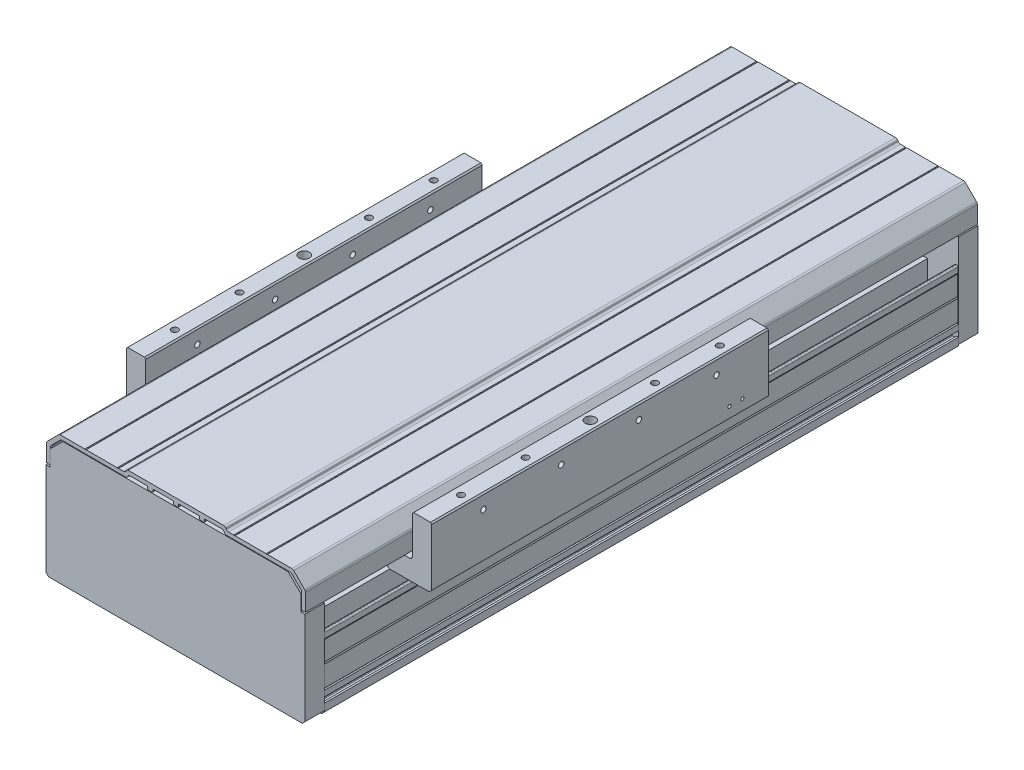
from build123d import *

# Parameters (mm, degrees)
EXTRUDE_1_DEPTH             = 245
EXTRUDE_2_DEPTH             = 15
EXTRUDE_3_DEPTH             = 15
EXTRUDE_4_DEPTH             = 260
EXTRUDE_5_DEPTH             = 259.5
HOLE_WIZARD_M8_1_AT_2_COUNT = 2
HOLE_WIZARD_M8_1_AT_2_PITCH = 173
PATTERN_LINEAR_1_COUNT      = 2
PATTERN_LINEAR_1_PITCH      = 240
HOLE_WIZARD_M6_1_AT_2_COUNT = 2
HOLE_WIZARD_M6_1_AT_2_PITCH = 50
HOLE_WIZARD_M6_1_AT_3_COUNT = 2
HOLE_WIZARD_M6_1_AT_3_PITCH = 150
HOLE_WIZARD_M6_1_AT_4_COUNT = 2
HOLE_WIZARD_M6_1_AT_4_PITCH = 200
HOLE_WIZARD_M5_1_AT_2_COUNT = 2
HOLE_WIZARD_M5_1_AT_2_PITCH = 60
HOLE_WIZARD_M5_1_AT_3_COUNT = 2
HOLE_WIZARD_M5_1_AT_3_PITCH = 120
HOLE_WIZARD_M5_1_AT_4_COUNT = 2
HOLE_WIZARD_M5_1_AT_4_PITCH = 180
SKETCH_14_R                 = 2.5
CUT_EXTRUDE_1_DEPTH         = 47
SKETCH_15_R                 = 4
CUT_EXTRUDE_2_DEPTH         = 18
HOLE_WIZARD_M3_1_AT_2_COUNT = 2
HOLE_WIZARD_M3_1_AT_2_PITCH = 10


with BuildPart() as part:
    # Sketch 1 → Extrude 1 (new, symmetric)
    # profile 1 of 3: a face of its own
    with BuildSketch(Plane.XY):
        with BuildLine():
            Line((-99, 33.5), (-99, 48.5))
            Line((-99, 48.5), (-99.5, 49.5))
            Line((-99.5, 49.5), (-99.5, 53.5))
            ThreePointArc((-99.5, 53.5), (-99.207106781, 54.207106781), (-98.5, 54.5))
            Line((-98.5, 54.5), (-98, 54.5))
            ThreePointArc((-98, 54.5), (-97.292893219, 54.207106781), (-97, 53.5))
            Line((-97, 53.5), (-97, 16.5))
            ThreePointArc((-97, 16.5), (-97.146446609, 16.146446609), (-97.5, 16))
            Line((-97.5, 16), (-99, 16))
            ThreePointArc((-99, 16), (-99.353553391, 16.146446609), (-99.5, 16.5))
            Line((-99.5, 16.5), (-99.5, 32.5))
            Line((-99.5, 32.5), (-99, 33.5))
        make_face()
    # profile 2 of 3: a face of its own
    with BuildSketch(Plane.XY):
        with BuildLine():
            Line((99, 33.5), (99, 48.5))
            Line((99, 48.5), (99.5, 49.5))
            Line((99.5, 49.5), (99.5, 53.5))
            ThreePointArc((99.5, 53.5), (99.207106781, 54.207106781), (98.5, 54.5))
            Line((98.5, 54.5), (98, 54.5))
            ThreePointArc((98, 54.5), (97.292893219, 54.207106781), (97, 53.5))
            Line((97, 53.5), (97, 16.5))
            ThreePointArc((97, 16.5), (97.146446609, 16.146446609), (97.5, 16))
            Line((97.5, 16), (99, 16))
            ThreePointArc((99, 16), (99.353553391, 16.146446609), (99.5, 16.5))
            Line((99.5, 16.5), (99.5, 32.5))
            Line((99.5, 32.5), (99, 33.5))
        make_face()
    # profile 3 of 3: a face of its own
    with BuildSketch(Plane.XY):
        with BuildLine():
            Line((-78, 44.5), (-43.5, 44.5))
            Line((-43.5, 44.5), (-43.5, 22.499959))
            ThreePointArc((-43.5, 22.499959), (-42.035533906, 18.964425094), (-38.5, 17.499959))
            Line((-38.5, 17.499959), (-38.5, 16.499959))
            Line((-38.5, 16.499959), (-22.9999959, 16.499959))
            Line((-22.9999959, 16.499959), (-22.5, 15.999959))
            Line((-22.5, 15.999959), (22.5, 15.999959))
            Line((22.5, 15.999959), (22.9999959, 16.499959))
            Line((22.9999959, 16.499959), (38.5, 16.499959))
            Line((38.5, 16.499959), (38.5, 17.499959))
            ThreePointArc((38.5, 17.499959), (42.035533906, 18.964425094), (43.5, 22.499959))
            Line((43.5, 22.499959), (43.5, 44.5))
            Line((43.5, 44.5), (71, 44.5))
            Line((71, 44.5), (71, 47.5))
            Line((71, 47.5), (76, 47.5))
            Line((76, 47.5), (76, 31.4999))
            Line((76, 31.4999), (76.3, 31.4999))
            Line((76.3, 31.4999), (76.3, 24.58099761))
            ThreePointArc((76.3, 24.58099761), (76.246719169, 24.583200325), (76.193631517, 24.588240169))
            ThreePointArc((76.193631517, 24.588240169), (74.617365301, 22.19481599), (77.476923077, 22.384615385))
            ThreePointArc((77.476923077, 22.384615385), (77.845299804, 22.832050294), (78.4, 23))
            Line((78.4, 23), (80.8, 23))
            Line((80.8, 23), (81, 22.8))
            Line((81, 22.8), (81, 21.2))
            Line((81, 21.2), (80.8, 21))
            Line((80.8, 21), (79.5, 21))
            Line((79.5, 21), (79.5, 18))
            Line((79.5, 18), (93.5, 18))
            Line((93.5, 18), (93.5, 21))
            Line((93.5, 21), (92.2, 21))
            Line((92.2, 21), (92, 21.2))
            Line((92, 21.2), (92, 22.8))
            Line((92, 22.8), (92.2, 23))
            Line((92.2, 23), (94, 23))
            ThreePointArc((94, 23), (94.707106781, 23.292893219), (95, 24))
            Line((95, 24), (95, 25.5))
            Line((95, 25.5), (97, 25.5))
            Line((97, 25.5), (97, 22.000000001))
            Line((97, 22.000000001), (96.7, 21.5))
            Line((96.7, 21.5), (97, 21))
            Line((97, 21), (97, 15.5))
            Line((97, 15.5), (100, 15.5))
            Line((100, 15.5), (99.999985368, 11.15))
            Line((99.999985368, 11.15), (98.499985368, 11.15))
            Line((98.499985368, 11.15), (98.499985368, 12.65))
            Line((98.499985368, 12.65), (95.499985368, 12.65))
            ThreePointArc((95.499985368, 12.65), (95.146431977, 12.503553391), (94.999985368, 12.15))
            Line((94.999985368, 12.15), (94.999985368, 5.85))
            ThreePointArc((94.999985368, 5.85), (95.146431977, 5.496446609), (95.499985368, 5.35))
            Line((95.499985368, 5.35), (98.499985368, 5.35))
            Line((98.499985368, 5.35), (98.499985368, 6.85))
            Line((98.499985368, 6.85), (99.999985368, 6.85))
            Line((99.999985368, 6.85), (100, 1))
            Line((100, 1), (98, -1))
            Line((98, -1), (36, -1))
            Line((36, -1), (35, 0))
            Line((35, 0), (-35, 0))
            Line((-35, 0), (-36, -1))
            Line((-36, -1), (-98, -1))
            Line((-98, -1), (-100, 1))
            Line((-100, 1), (-99.999985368, 6.85))
            Line((-99.999985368, 6.85), (-98.499985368, 6.85))
            Line((-98.499985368, 6.85), (-98.499985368, 5.35))
            Line((-98.499985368, 5.35), (-95.499985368, 5.35))
            ThreePointArc((-95.499985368, 5.35), (-95.146431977, 5.496446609), (-94.999985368, 5.85))
            Line((-94.999985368, 5.85), (-94.999985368, 12.15))
            ThreePointArc((-94.999985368, 12.15), (-95.146431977, 12.503553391), (-95.499985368, 12.65))
            Line((-95.499985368, 12.65), (-98.499985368, 12.65))
            Line((-98.499985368, 12.65), (-98.499985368, 11.15))
            Line((-98.499985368, 11.15), (-99.999985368, 11.15))
            Line((-99.999985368, 11.15), (-100, 15.5))
            Line((-100, 15.5), (-97, 15.5))
            Line((-97, 15.5), (-97, 21))
            Line((-97, 21), (-96.7, 21.5))
            Line((-96.7, 21.5), (-97, 22))
            Line((-97, 22), (-97, 25.5))
            Line((-97, 25.5), (-95, 25.5))
            Line((-95, 25.5), (-95, 24))
            ThreePointArc((-95, 24), (-94.707106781, 23.292893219), (-94, 23))
            Line((-94, 23), (-92.2, 23))
            Line((-92.2, 23), (-92, 22.8))
            Line((-92, 22.8), (-92, 21.2))
            Line((-92, 21.2), (-92.2, 21))
            Line((-92.2, 21), (-93.5, 21))
            Line((-93.5, 21), (-93.5, 18))
            Line((-93.5, 18), (-79.5, 18))
            Line((-79.5, 18), (-79.5, 21))
            Line((-79.5, 21), (-80.8, 21))
            Line((-80.8, 21), (-81, 21.2))
            Line((-81, 21.2), (-81, 22.8))
            Line((-81, 22.8), (-80.8, 23))
            Line((-80.8, 23), (-78.4, 23))
            ThreePointArc((-78.4, 23), (-77.845299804, 22.832050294), (-77.476923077, 22.384615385))
            ThreePointArc((-77.476923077, 22.384615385), (-74.617365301, 22.19481599), (-76.193631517, 24.588240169))
            ThreePointArc((-76.193631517, 24.588240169), (-76.76123201, 24.686146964), (-77.180676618, 25.080890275))
            Line((-77.180676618, 25.080890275), (-78, 26.5))
            Line((-78, 26.5), (-78, 36.5))
            Line((-78, 36.5), (-77.7, 37))
            Line((-77.7, 37), (-78, 37.5))
            Line((-78, 37.5), (-78, 44.5))
        make_face()
        with BuildLine():
            Line((-66.55, 32.5), (-54.5, 32.5))
            ThreePointArc((-54.5, 32.5), (-53.085786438, 31.914213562), (-52.5, 30.5))
            Line((-52.5, 30.5), (-52.5, 16.25))
            ThreePointArc((-52.5, 16.25), (-52.353553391, 15.896446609), (-52, 15.75))
            Line((-52, 15.75), (-51.407878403, 15.75))
            ThreePointArc((-51.407878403, 15.75), (-51.235654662, 15.780597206), (-51.084509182, 15.868644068))
            ThreePointArc((-51.084509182, 15.868644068), (-47.054594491, 13.850026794), (-51.300978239, 12.338983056))
            ThreePointArc((-51.300978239, 12.338983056), (-51.467890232, 12.457980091), (-51.668524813, 12.5))
            Line((-51.668524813, 12.5), (-67.5, 12.5))
            ThreePointArc((-67.5, 12.5), (-68.914213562, 13.085786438), (-69.5, 14.5))
            Line((-69.5, 14.5), (-69.5, 30.092681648))
            ThreePointArc((-69.5, 30.092681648), (-69.617656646, 30.414882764), (-69.915254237, 30.58544747))
            ThreePointArc((-69.915254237, 30.58544747), (-71.07878547, 34.873482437), (-67.05, 33))
            ThreePointArc((-67.05, 33), (-66.903553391, 32.646446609), (-66.55, 32.5))
        make_face(mode=Mode.SUBTRACT)
        with BuildLine():
            Line((-16.901923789, 9.5), (-14.303847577, 11))
            Line((-14.303847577, 11), (-7.333333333, 11))
            Line((-7.333333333, 11), (-4, 9))
            Line((-4, 9), (4, 9))
            Line((4, 9), (7.333333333, 11))
            Line((7.333333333, 11), (14.303847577, 11))
            Line((14.303847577, 11), (16.901923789, 9.5))
            Line((16.901923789, 9.5), (18.062862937, 9.5))
            ThreePointArc((18.062862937, 9.5), (22.45, 8), (18.062862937, 6.5))
            Line((18.062862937, 6.5), (16.901923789, 6.5))
            Line((16.901923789, 6.5), (14.303847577, 5))
            Line((14.303847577, 5), (-14.303847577, 5))
            Line((-14.303847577, 5), (-16.901923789, 6.5))
            Line((-16.901923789, 6.5), (-18.062862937, 6.5))
            ThreePointArc((-18.062862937, 6.5), (-22.45, 8), (-18.062862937, 9.5))
            Line((-18.062862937, 9.5), (-16.901923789, 9.5))
        make_face(mode=Mode.SUBTRACT)
        with BuildLine():
            Line((66.549999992, 32.500000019), (54.499999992, 32.500000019))
            ThreePointArc((54.499999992, 32.500000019), (53.085786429, 31.914213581), (52.499999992, 30.500000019))
            Line((52.499999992, 30.500000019), (52.499999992, 16.250000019))
            ThreePointArc((52.499999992, 16.250000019), (52.353553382, 15.896446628), (51.999999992, 15.750000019))
            Line((51.999999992, 15.750000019), (51.407878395, 15.750000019))
            ThreePointArc((51.407878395, 15.750000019), (51.235654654, 15.780597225), (51.084509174, 15.868644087))
            ThreePointArc((51.084509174, 15.868644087), (47.054594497, 13.850026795), (51.30097824, 12.338983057))
            ThreePointArc((51.30097824, 12.338983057), (51.467890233, 12.457980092), (51.668524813, 12.5))
            Line((51.668524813, 12.5), (67.5, 12.5))
            ThreePointArc((67.5, 12.5), (68.914213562, 13.085786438), (69.5, 14.5))
            Line((69.5, 14.5), (69.5, 30.092681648))
            ThreePointArc((69.5, 30.092681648), (69.617656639, 30.414882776), (69.915254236, 30.585447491))
            ThreePointArc((69.915254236, 30.585447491), (71.078785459, 34.873482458), (67.049999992, 33.000000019))
            ThreePointArc((67.049999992, 33.000000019), (66.903553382, 32.646446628), (66.549999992, 32.500000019))
        make_face(mode=Mode.SUBTRACT)
    extrude(amount=EXTRUDE_1_DEPTH, both=True)

    # Sketch 7 → Hole Wizard M8 _ _ _ _1 (revolve, cut)
    with BuildSketch(Plane(origin=(-86.5, 18, 120), x_dir=(0, 0, 1), z_dir=(1, 0, 0))):
        Polygon((0, 0), (0, 19), (4.5, 19), (4.5, 9), (7, 9), (7, 0), align=None)
    hole_wizard_m8_1 = revolve(axis=Axis((-86.5, 24.35, 120), (0, -1, 0)), mode=Mode.SUBTRACT)

    # Hole Wizard M8 _ _ _ _1 at 2: Hole Wizard M8 _ _ _ _1 ×2
    with Locations(*[(i * HOLE_WIZARD_M8_1_AT_2_PITCH, 0, 0) for i in range(1, HOLE_WIZARD_M8_1_AT_2_COUNT)]):
        add(hole_wizard_m8_1, mode=Mode.SUBTRACT)

    # Pattern Linear 1: Hole Wizard M8 _ _ _ _1 ×2
    with Locations(*[(0, 0, -i * PATTERN_LINEAR_1_PITCH) for i in range(1, PATTERN_LINEAR_1_COUNT)]):
        add(hole_wizard_m8_1, mode=Mode.SUBTRACT)

    # Pattern Linear 1 copy 1 sketch → Pattern Linear 1 copy 1 (revolve, cut)
    with BuildSketch(Plane(origin=(86.5, 18, -120), x_dir=(0, 0, 1), z_dir=(1, 0, 0))):
        Polygon((0, 0), (0, 19), (4.5, 19), (4.5, 9), (7, 9), (7, 0), align=None)
    revolve(axis=Axis((86.5, 24.35, -120), (0, -1, 0)), mode=Mode.SUBTRACT)


with BuildPart() as body_2:
    # Sketch 2 → Extrude 2 (new body)
    with BuildSketch(Plane.XY.offset(245)):
        Polygon((97.000014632, 86.000015), (87.000014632, 96.000015), (-86.999985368, 96.000015), (-96.999985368, 86.000015), (-96.999985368, 74), (-99.999985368, 74), (-99.999985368, 2), (-97.999985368, 0), (97.999985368, 0), (100.000014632, 2.000029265), (100.000014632, 74), (97.000014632, 74), align=None)
    extrude(amount=EXTRUDE_2_DEPTH)


with BuildPart() as body_3:
    # Sketch 3 → Extrude 3 (new body)
    with BuildSketch(Plane(origin=(0, 0, -245), x_dir=(-1, 0, 0), z_dir=(0, 0, -1))):
        Polygon((97.000014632, 86.000015), (87.000014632, 96.000015), (-86.999985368, 96.000015), (-96.999985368, 86.000015), (-96.999985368, 74), (-99.999985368, 74), (-99.999985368, 2), (-97.999985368, 0), (97.999985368, 0), (100.000014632, 2.000029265), (100.000014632, 74), (97.000014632, 74), align=None)
    extrude(amount=EXTRUDE_3_DEPTH)


with BuildPart() as body_4:
    # Sketch 4 → Extrude 4 (new body)
    with BuildSketch(Plane.XY.offset(180)):
        with BuildLine():
            ThreePointArc((-103, 74), (-102.414213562, 72.585786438), (-101, 72))
            Line((-101, 72), (-96, 72))
            ThreePointArc((-96, 72), (-94.585786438, 72.585786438), (-94, 74))
            Line((-94, 74), (-94, 77.5))
            ThreePointArc((-94, 77.5), (-91.071067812, 84.571067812), (-84, 87.5))
            Line((-84, 87.5), (-58.5, 87.5))
            Line((-58.5, 87.5), (-56.5, 89.5))
            Line((-56.5, 89.5), (56.5, 89.5))
            Line((56.5, 89.5), (58.5, 87.5))
            Line((58.5, 87.5), (84, 87.5))
            ThreePointArc((84, 87.5), (91.071067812, 84.571067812), (94, 77.5))
            Line((94, 77.5), (94, 74))
            ThreePointArc((94, 74), (94.585786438, 72.585786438), (96, 72))
            Line((96, 72), (101, 72))
            ThreePointArc((101, 72), (102.414213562, 72.585786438), (103, 74))
            Line((103, 74), (103, 103))
            Line((103, 103), (104, 104))
            Line((104, 104), (117, 104))
            Line((117, 104), (118, 103))
            Line((118, 103), (118, 59))
            Line((118, 59), (116, 57))
            Line((116, 57), (85, 57))
            Line((85, 57), (83, 59))
            Line((83, 59), (83, 72.5))
            Line((83, 72.5), (-83, 72.5))
            Line((-83, 72.5), (-83, 59))
            Line((-83, 59), (-85, 57))
            Line((-85, 57), (-116, 57))
            Line((-116, 57), (-118, 59))
            Line((-118, 59), (-118, 103))
            Line((-118, 103), (-117, 104))
            Line((-117, 104), (-104, 104))
            Line((-104, 104), (-103, 103))
            Line((-103, 103), (-103, 74))
        make_face()
    extrude(amount=-EXTRUDE_4_DEPTH)

    # Sketch 9 → Hole Wizard M6 _ _1 (revolve, cut)
    with BuildSketch(Plane(origin=(110.5, 104, 150), x_dir=(0, 0, 1), z_dir=(1, 0, 0))):
        Polygon((0, 0), (0, 24.502151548), (2.5, 23), (2.5, 0), align=None)
    hole_wizard_m6_1 = revolve(axis=Axis((110.5, 110.35, 150), (0, -1, 0)), mode=Mode.SUBTRACT)

    # Hole Wizard M6 _ _1 at 2: Hole Wizard M6 _ _1 ×2
    with Locations(*[(0, 0, -i * HOLE_WIZARD_M6_1_AT_2_PITCH) for i in range(1, HOLE_WIZARD_M6_1_AT_2_COUNT)]):
        add(hole_wizard_m6_1, mode=Mode.SUBTRACT)

    # Hole Wizard M6 _ _1 at 3: Hole Wizard M6 _ _1 ×2
    with Locations(*[(0, 0, -i * HOLE_WIZARD_M6_1_AT_3_PITCH) for i in range(1, HOLE_WIZARD_M6_1_AT_3_COUNT)]):
        add(hole_wizard_m6_1, mode=Mode.SUBTRACT)

    # Hole Wizard M6 _ _1 at 4: Hole Wizard M6 _ _1 ×2
    with Locations(*[(0, 0, -i * HOLE_WIZARD_M6_1_AT_4_PITCH) for i in range(1, HOLE_WIZARD_M6_1_AT_4_COUNT)]):
        add(hole_wizard_m6_1, mode=Mode.SUBTRACT)

    # Sketch 11 → Hole Wizard M5 _ _1 (revolve, cut)
    with BuildSketch(Plane(origin=(118, 93, 140), x_dir=(0, 0, -1), z_dir=(0, 1, 0))):
        Polygon((0, 0), (0, 17.2618073), (2.1, 16), (2.1, 0), align=None)
    hole_wizard_m5_1 = revolve(axis=Axis((124.35, 93, 140), (-1, 0, 0)), mode=Mode.SUBTRACT)

    # Hole Wizard M5 _ _1 at 2: Hole Wizard M5 _ _1 ×2
    with Locations(*[(0, 0, -i * HOLE_WIZARD_M5_1_AT_2_PITCH) for i in range(1, HOLE_WIZARD_M5_1_AT_2_COUNT)]):
        add(hole_wizard_m5_1, mode=Mode.SUBTRACT)

    # Hole Wizard M5 _ _1 at 3: Hole Wizard M5 _ _1 ×2
    with Locations(*[(0, 0, -i * HOLE_WIZARD_M5_1_AT_3_PITCH) for i in range(1, HOLE_WIZARD_M5_1_AT_3_COUNT)]):
        add(hole_wizard_m5_1, mode=Mode.SUBTRACT)

    # Hole Wizard M5 _ _1 at 4: Hole Wizard M5 _ _1 ×2
    with Locations(*[(0, 0, -i * HOLE_WIZARD_M5_1_AT_4_PITCH) for i in range(1, HOLE_WIZARD_M5_1_AT_4_COUNT)]):
        add(hole_wizard_m5_1, mode=Mode.SUBTRACT)

    # Sketch 14 → Cut-Extrude 1 (cut)
    with BuildSketch(Plane(origin=(0, 104, 0), x_dir=(-1, 0, 0), z_dir=(0, 1, 0))):
        with Locations(Location((-110.5, 50, 0), (0, 0, 90))):
            Circle(SKETCH_14_R)
    cut_extrude_1 = extrude(amount=-CUT_EXTRUDE_1_DEPTH, mode=Mode.SUBTRACT)

    # Sketch 15 → Cut-Extrude 2 (cut)
    with BuildSketch(Plane(origin=(0, 104, 0), x_dir=(1, 0, 0), z_dir=(0, 1, 0))):
        with Locations(Location((110.5, -50, 0), (0, 0, 270))):
            Circle(SKETCH_15_R)
    cut_extrude_2 = extrude(amount=-CUT_EXTRUDE_2_DEPTH, mode=Mode.SUBTRACT)

    # Mirror 1: Hole Wizard M6 _ _1, Hole Wizard M5 _ _1, Cut-Extrude 1, Cut-Extrude 2 across plane
    add(hole_wizard_m6_1.mirror(Plane(origin=(0, 0, 0), x_dir=(0, 0, 1), z_dir=(1, 0, 0))), mode=Mode.SUBTRACT)
    add(hole_wizard_m5_1.mirror(Plane(origin=(0, 0, 0), x_dir=(0, 0, 1), z_dir=(1, 0, 0))), mode=Mode.SUBTRACT)
    add(cut_extrude_1.mirror(Plane(origin=(0, 0, 0), x_dir=(0, 0, 1), z_dir=(1, 0, 0))), mode=Mode.SUBTRACT)
    add(cut_extrude_2.mirror(Plane(origin=(0, 0, 0), x_dir=(0, 0, 1), z_dir=(1, 0, 0))), mode=Mode.SUBTRACT)

    # Mirror 1 copy 1 sketch → Mirror 1 copy 1 (revolve, cut)
    with BuildSketch(Plane(origin=(-110.5, 104, 100), x_dir=(0, 0, 1), z_dir=(-1, 0, 0))):
        Polygon((0, 0), (0, -24.502151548), (2.5, -23), (2.5, 0), align=None)
    revolve(axis=Axis((-110.5, 110.35, 100), (0, 1, 0)), mode=Mode.SUBTRACT)

    # Mirror 1 copy 2 sketch → Mirror 1 copy 2 (revolve, cut)
    with BuildSketch(Plane(origin=(-110.5, 104, 0), x_dir=(0, 0, 1), z_dir=(-1, 0, 0))):
        Polygon((0, 0), (0, -24.502151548), (2.5, -23), (2.5, 0), align=None)
    revolve(axis=Axis((-110.5, 110.35, 0), (0, 1, 0)), mode=Mode.SUBTRACT)

    # Mirror 1 copy 3 sketch → Mirror 1 copy 3 (revolve, cut)
    with BuildSketch(Plane(origin=(-110.5, 104, -50), x_dir=(0, 0, 1), z_dir=(-1, 0, 0))):
        Polygon((0, 0), (0, -24.502151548), (2.5, -23), (2.5, 0), align=None)
    revolve(axis=Axis((-110.5, 110.35, -50), (0, 1, 0)), mode=Mode.SUBTRACT)

    # Mirror 1 copy 4 sketch → Mirror 1 copy 4 (revolve, cut)
    with BuildSketch(Plane(origin=(-118, 93, 80), x_dir=(0, 0, -1), z_dir=(0, 1, 0))):
        Polygon((0, 0), (0, -17.2618073), (2.1, -16), (2.1, 0), align=None)
    revolve(axis=Axis((-124.35, 93, 80), (-1, 0, 0)), mode=Mode.SUBTRACT)

    # Mirror 1 copy 5 sketch → Mirror 1 copy 5 (revolve, cut)
    with BuildSketch(Plane(origin=(-118, 93, 20), x_dir=(0, 0, -1), z_dir=(0, 1, 0))):
        Polygon((0, 0), (0, -17.2618073), (2.1, -16), (2.1, 0), align=None)
    revolve(axis=Axis((-124.35, 93, 20), (-1, 0, 0)), mode=Mode.SUBTRACT)

    # Mirror 1 copy 6 sketch → Mirror 1 copy 6 (revolve, cut)
    with BuildSketch(Plane(origin=(-118, 93, -40), x_dir=(0, 0, -1), z_dir=(0, 1, 0))):
        Polygon((0, 0), (0, -17.2618073), (2.1, -16), (2.1, 0), align=None)
    revolve(axis=Axis((-124.35, 93, -40), (-1, 0, 0)), mode=Mode.SUBTRACT)

    # Sketch 16 → Hole Wizard M3 _ _1 (revolve, cut)
    with BuildSketch(Plane(origin=(118, 67, -60), x_dir=(0, 0, -1), z_dir=(0, 1, 0))):
        Polygon((0, 0), (0, 13.251075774), (1.25, 12.5), (1.25, 0), align=None)
    hole_wizard_m3_1 = revolve(axis=Axis((124.35, 67, -60), (-1, 0, 0)), mode=Mode.SUBTRACT)

    # Hole Wizard M3 _ _1 at 2: Hole Wizard M3 _ _1 ×2
    with Locations(*[(0, 0, i * HOLE_WIZARD_M3_1_AT_2_PITCH) for i in range(1, HOLE_WIZARD_M3_1_AT_2_COUNT)]):
        add(hole_wizard_m3_1, mode=Mode.SUBTRACT)

    # Mirror 2: Hole Wizard M3 _ _1 across plane
    add(hole_wizard_m3_1.mirror(Plane(origin=(0, 0, 0), x_dir=(0, 0, 1), z_dir=(1, 0, 0))), mode=Mode.SUBTRACT)

    # Mirror 2 copy 1 sketch → Mirror 2 copy 1 (revolve, cut)
    with BuildSketch(Plane(origin=(-118, 67, -50), x_dir=(0, 0, -1), z_dir=(0, 1, 0))):
        Polygon((0, 0), (0, -13.251075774), (1.25, -12.5), (1.25, 0), align=None)
    revolve(axis=Axis((-124.35, 67, -50), (-1, 0, 0)), mode=Mode.SUBTRACT)


with BuildPart() as body_5:
    # Sketch 5 → Extrude 5 (new, symmetric)
    with BuildSketch(Plane.XY):
        with BuildLine():
            Line((36.749407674, 101.5), (-36.749407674, 101.5))
            ThreePointArc((-36.749407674, 101.5), (-37.719816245, 101.248801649), (-38.446459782, 100.558307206))
            Line((-38.446459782, 100.558307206), (-38.830989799, 99.941692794))
            ThreePointArc((-38.830989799, 99.941692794), (-39.557633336, 99.251198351), (-40.528041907, 99))
            Line((-40.528041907, 99), (-44.5, 99))
            Line((-44.5, 99), (-45, 98.7))
            Line((-45, 98.7), (-45.5, 99))
            Line((-45.5, 99), (-69.5, 99))
            Line((-69.5, 99), (-70, 98.7))
            Line((-70, 98.7), (-70.5, 99))
            Line((-70.5, 99), (-89.369129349, 99))
            ThreePointArc((-89.369129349, 99), (-90.134496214, 98.847759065), (-90.783342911, 98.414213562))
            Line((-90.783342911, 98.414213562), (-99.414213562, 89.783342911))
            ThreePointArc((-99.414213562, 89.783342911), (-99.847759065, 89.134496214), (-100, 88.369129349))
            Line((-100, 88.369129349), (-100, 75))
            Line((-100, 75), (-97, 75))
            Line((-97, 75), (-97, 87.126488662))
            ThreePointArc((-97, 87.126488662), (-96.847759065, 87.891855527), (-96.414213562, 88.540702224))
            Line((-96.414213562, 88.540702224), (-89.540702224, 95.414213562))
            ThreePointArc((-89.540702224, 95.414213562), (-88.891855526, 95.847759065), (-88.126488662, 96))
            Line((-88.126488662, 96), (-39.21505842, 96))
            ThreePointArc((-39.21505842, 96), (-38.244649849, 96.251198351), (-37.518006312, 96.941692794))
            Line((-37.518006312, 96.941692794), (-37.133476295, 97.558307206))
            ThreePointArc((-37.133476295, 97.558307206), (-36.406832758, 98.248801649), (-35.436424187, 98.5))
            Line((-35.436424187, 98.5), (-22.25, 98.5))
            ThreePointArc((-22.25, 98.5), (-22.073223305, 98.426776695), (-22, 98.25))
            Line((-22, 98.25), (-22, 96.75))
            ThreePointArc((-22, 96.75), (-21.780330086, 96.219669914), (-21.25, 96))
            Line((-21.25, 96), (-18.75, 96))
            ThreePointArc((-18.75, 96), (-18.219669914, 96.219669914), (-18, 96.75))
            Line((-18, 96.75), (-18, 98.25))
            ThreePointArc((-18, 98.25), (-17.926776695, 98.426776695), (-17.75, 98.5))
            Line((-17.75, 98.5), (-2.25, 98.5))
            ThreePointArc((-2.25, 98.5), (-2.073223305, 98.426776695), (-2, 98.25))
            Line((-2, 98.25), (-2, 96.75))
            ThreePointArc((-2, 96.75), (-1.780330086, 96.219669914), (-1.25, 96))
            Line((-1.25, 96), (1.25, 96))
            ThreePointArc((1.25, 96), (1.780330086, 96.219669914), (2, 96.75))
            Line((2, 96.75), (2, 98.25))
            ThreePointArc((2, 98.25), (2.073223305, 98.426776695), (2.25, 98.5))
            Line((2.25, 98.5), (17.75, 98.5))
            ThreePointArc((17.75, 98.5), (17.926776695, 98.426776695), (18, 98.25))
            Line((18, 98.25), (18, 96.75))
            ThreePointArc((18, 96.75), (18.219669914, 96.219669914), (18.75, 96))
            Line((18.75, 96), (21.25, 96))
            ThreePointArc((21.25, 96), (21.780330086, 96.219669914), (22, 96.75))
            Line((22, 96.75), (22, 98.25))
            ThreePointArc((22, 98.25), (22.073223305, 98.426776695), (22.25, 98.5))
            Line((22.25, 98.5), (35.436424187, 98.5))
            ThreePointArc((35.436424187, 98.5), (36.406832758, 98.248801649), (37.133476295, 97.558307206))
            Line((37.133476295, 97.558307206), (37.518006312, 96.941692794))
            ThreePointArc((37.518006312, 96.941692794), (38.244649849, 96.251198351), (39.21505842, 96))
            Line((39.21505842, 96), (88.126488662, 96))
            ThreePointArc((88.126488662, 96), (88.891855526, 95.847759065), (89.540702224, 95.414213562))
            Line((89.540702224, 95.414213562), (96.414213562, 88.540702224))
            ThreePointArc((96.414213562, 88.540702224), (96.847759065, 87.891855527), (97, 87.126488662))
            Line((97, 87.126488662), (97, 75))
            Line((97, 75), (100, 75))
            Line((100, 75), (100, 88.369129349))
            ThreePointArc((100, 88.369129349), (99.847759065, 89.134496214), (99.414213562, 89.783342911))
            Line((99.414213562, 89.783342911), (90.783342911, 98.414213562))
            ThreePointArc((90.783342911, 98.414213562), (90.134496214, 98.847759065), (89.369129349, 99))
            Line((89.369129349, 99), (70.5, 99))
            Line((70.5, 99), (70, 98.7))
            Line((70, 98.7), (69.5, 99))
            Line((69.5, 99), (45.5, 99))
            Line((45.5, 99), (45, 98.7))
            Line((45, 98.7), (44.5, 99))
            Line((44.5, 99), (40.528041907, 99))
            ThreePointArc((40.528041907, 99), (39.557633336, 99.251198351), (38.830989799, 99.941692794))
            Line((38.830989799, 99.941692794), (38.446459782, 100.558307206))
            ThreePointArc((38.446459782, 100.558307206), (37.719816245, 101.248801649), (36.749407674, 101.5))
        make_face()
    extrude(amount=EXTRUDE_5_DEPTH, both=True)


solid = Compound([part.part, body_2.part, body_3.part, body_4.part, body_5.part])
